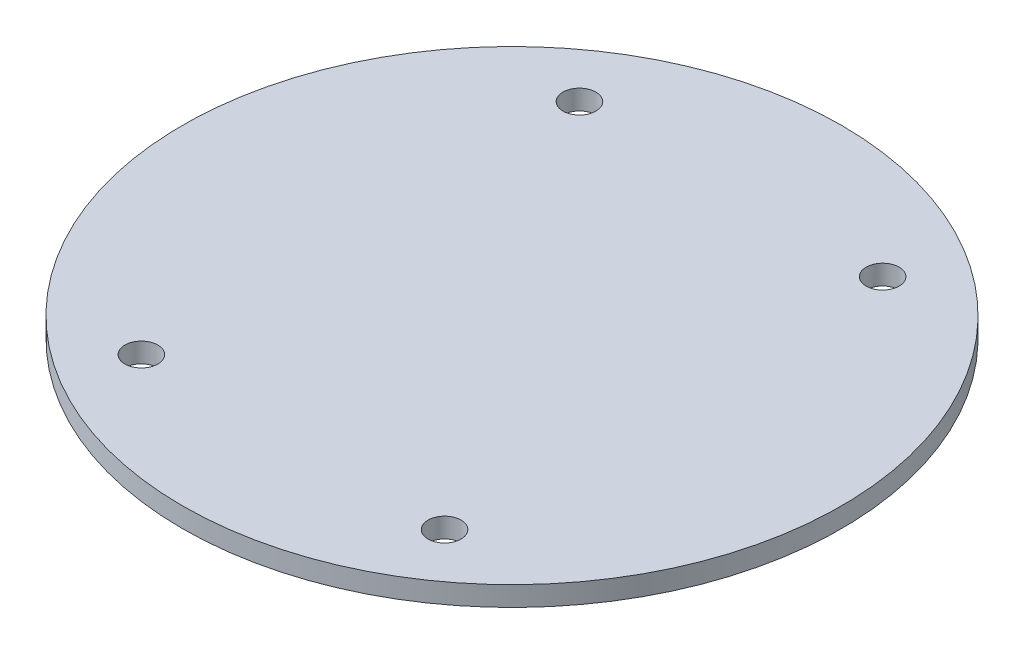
ISO-10303-21;
HEADER;
FILE_DESCRIPTION(('STEP AP214'),'2;1');
FILE_NAME('part.step','',(''),(''),'','','');
FILE_SCHEMA(('AUTOMOTIVE_DESIGN { 1 0 10303 214 1 1 1 1 }'));
ENDSEC;
DATA;
#1=APPLICATION_CONTEXT('core data for automotive mechanical design processes');
#2=APPLICATION_PROTOCOL_DEFINITION('international standard','automotive_design',2000,#1);
#3=PRODUCT_CONTEXT('',#1,'mechanical');
#4=PRODUCT('Part','Part','',(#3));
#5=PRODUCT_RELATED_PRODUCT_CATEGORY('part','',(#4));
#6=PRODUCT_DEFINITION_FORMATION('','',#4);
#7=PRODUCT_DEFINITION_CONTEXT('part definition',#1,'design');
#8=PRODUCT_DEFINITION('design','',#6,#7);
#9=PRODUCT_DEFINITION_SHAPE('','',#8);
#10=(LENGTH_UNIT() NAMED_UNIT(*) SI_UNIT(.MILLI.,.METRE.));
#11=(NAMED_UNIT(*) PLANE_ANGLE_UNIT() SI_UNIT($,.RADIAN.));
#12=(NAMED_UNIT(*) SI_UNIT($,.STERADIAN.) SOLID_ANGLE_UNIT());
#13=UNCERTAINTY_MEASURE_WITH_UNIT(LENGTH_MEASURE(1.E-05),#10,'distance_accuracy_value','');
#14=(GEOMETRIC_REPRESENTATION_CONTEXT(3) GLOBAL_UNCERTAINTY_ASSIGNED_CONTEXT((#13)) GLOBAL_UNIT_ASSIGNED_CONTEXT((#10,
#11,#12)) REPRESENTATION_CONTEXT('',''));
#15=CARTESIAN_POINT('',(0.,0.,0.));
#16=DIRECTION('',(0.,0.,1.));
#17=DIRECTION('',(1.,0.,0.));
#18=AXIS2_PLACEMENT_3D('',#15,#16,#17);
#19=CARTESIAN_POINT('',(0.,3.,0.));
#20=DIRECTION('',(0.,-1.,0.));
#21=DIRECTION('',(0.,0.,-1.));
#22=AXIS2_PLACEMENT_3D('',#19,#20,#21);
#23=CYLINDRICAL_SURFACE('',#22,50.);
#24=CARTESIAN_POINT('',(0.,3.,0.));
#25=DIRECTION('',(0.,1.,0.));
#26=DIRECTION('',(0.,0.,1.));
#27=AXIS2_PLACEMENT_3D('',#24,#25,#26);
#28=CIRCLE('',#27,50.);
#29=CARTESIAN_POINT('',(0.,3.,50.));
#30=VERTEX_POINT('',#29);
#31=EDGE_CURVE('E10',#30,#30,#28,.T.);
#32=ORIENTED_EDGE('',*,*,#31,.F.);
#33=EDGE_LOOP('',(#32));
#34=FACE_BOUND('',#33,.T.);
#35=CARTESIAN_POINT('',(0.,0.,0.));
#36=DIRECTION('',(0.,1.,0.));
#37=DIRECTION('',(0.,0.,1.));
#38=AXIS2_PLACEMENT_3D('',#35,#36,#37);
#39=CIRCLE('',#38,50.);
#40=CARTESIAN_POINT('',(0.,0.,50.));
#41=VERTEX_POINT('',#40);
#42=EDGE_CURVE('E34',#41,#41,#39,.T.);
#43=ORIENTED_EDGE('',*,*,#42,.T.);
#44=EDGE_LOOP('',(#43));
#45=FACE_BOUND('',#44,.T.);
#46=ADVANCED_FACE('F31',(#34,#45),#23,.T.);
#47=CARTESIAN_POINT('',(0.,3.,0.));
#48=DIRECTION('',(0.,1.,0.));
#49=DIRECTION('',(0.,0.,1.));
#50=AXIS2_PLACEMENT_3D('',#47,#48,#49);
#51=PLANE('',#50);
#52=CARTESIAN_POINT('',(-23.,3.,33.2340187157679));
#53=DIRECTION('',(0.,1.,0.));
#54=DIRECTION('',(0.,0.,-1.));
#55=AXIS2_PLACEMENT_3D('',#52,#53,#54);
#56=CIRCLE('',#55,2.5);
#57=CARTESIAN_POINT('',(-23.,3.,30.7340187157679));
#58=VERTEX_POINT('',#57);
#59=EDGE_CURVE('E61',#58,#58,#56,.T.);
#60=ORIENTED_EDGE('',*,*,#59,.F.);
#61=EDGE_LOOP('',(#60));
#62=FACE_BOUND('',#61,.T.);
#63=CARTESIAN_POINT('',(23.,3.,33.2340187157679));
#64=DIRECTION('',(0.,1.,0.));
#65=DIRECTION('',(0.,0.,1.));
#66=AXIS2_PLACEMENT_3D('',#63,#64,#65);
#67=CIRCLE('',#66,2.5);
#68=CARTESIAN_POINT('',(23.,3.,35.7340187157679));
#69=VERTEX_POINT('',#68);
#70=EDGE_CURVE('E55',#69,#69,#67,.T.);
#71=ORIENTED_EDGE('',*,*,#70,.F.);
#72=EDGE_LOOP('',(#71));
#73=FACE_BOUND('',#72,.T.);
#74=CARTESIAN_POINT('',(23.,3.,-33.2340187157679));
#75=DIRECTION('',(0.,1.,0.));
#76=DIRECTION('',(0.,0.,-1.));
#77=AXIS2_PLACEMENT_3D('',#74,#75,#76);
#78=CIRCLE('',#77,2.5);
#79=CARTESIAN_POINT('',(23.,3.,-35.7340187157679));
#80=VERTEX_POINT('',#79);
#81=EDGE_CURVE('E49',#80,#80,#78,.T.);
#82=ORIENTED_EDGE('',*,*,#81,.F.);
#83=EDGE_LOOP('',(#82));
#84=FACE_BOUND('',#83,.T.);
#85=CARTESIAN_POINT('',(-23.,3.,-33.2340187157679));
#86=DIRECTION('',(0.,1.,0.));
#87=DIRECTION('',(0.,0.,1.));
#88=AXIS2_PLACEMENT_3D('',#85,#86,#87);
#89=CIRCLE('',#88,2.5);
#90=CARTESIAN_POINT('',(-23.,3.,-30.7340187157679));
#91=VERTEX_POINT('',#90);
#92=EDGE_CURVE('E43',#91,#91,#89,.T.);
#93=ORIENTED_EDGE('',*,*,#92,.F.);
#94=EDGE_LOOP('',(#93));
#95=FACE_BOUND('',#94,.T.);
#96=ORIENTED_EDGE('',*,*,#31,.T.);
#97=EDGE_LOOP('',(#96));
#98=FACE_BOUND('',#97,.T.);
#99=ADVANCED_FACE('F77',(#62,#73,#84,#95,#98),#51,.T.);
#100=CARTESIAN_POINT('',(0.,0.,0.));
#101=DIRECTION('',(0.,1.,0.));
#102=DIRECTION('',(0.,0.,1.));
#103=AXIS2_PLACEMENT_3D('',#100,#101,#102);
#104=PLANE('',#103);
#105=CARTESIAN_POINT('',(-23.,0.,33.2340187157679));
#106=DIRECTION('',(0.,1.,0.));
#107=DIRECTION('',(0.,0.,-1.));
#108=AXIS2_PLACEMENT_3D('',#105,#106,#107);
#109=CIRCLE('',#108,2.5);
#110=CARTESIAN_POINT('',(-23.,0.,30.7340187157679));
#111=VERTEX_POINT('',#110);
#112=EDGE_CURVE('E58',#111,#111,#109,.T.);
#113=ORIENTED_EDGE('',*,*,#112,.T.);
#114=EDGE_LOOP('',(#113));
#115=FACE_BOUND('',#114,.T.);
#116=CARTESIAN_POINT('',(23.,0.,33.2340187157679));
#117=DIRECTION('',(0.,1.,0.));
#118=DIRECTION('',(0.,0.,1.));
#119=AXIS2_PLACEMENT_3D('',#116,#117,#118);
#120=CIRCLE('',#119,2.5);
#121=CARTESIAN_POINT('',(23.,0.,35.7340187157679));
#122=VERTEX_POINT('',#121);
#123=EDGE_CURVE('E52',#122,#122,#120,.T.);
#124=ORIENTED_EDGE('',*,*,#123,.T.);
#125=EDGE_LOOP('',(#124));
#126=FACE_BOUND('',#125,.T.);
#127=CARTESIAN_POINT('',(23.,0.,-33.2340187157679));
#128=DIRECTION('',(0.,1.,0.));
#129=DIRECTION('',(0.,0.,-1.));
#130=AXIS2_PLACEMENT_3D('',#127,#128,#129);
#131=CIRCLE('',#130,2.5);
#132=CARTESIAN_POINT('',(23.,0.,-35.7340187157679));
#133=VERTEX_POINT('',#132);
#134=EDGE_CURVE('E46',#133,#133,#131,.T.);
#135=ORIENTED_EDGE('',*,*,#134,.T.);
#136=EDGE_LOOP('',(#135));
#137=FACE_BOUND('',#136,.T.);
#138=CARTESIAN_POINT('',(-23.,0.,-33.2340187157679));
#139=DIRECTION('',(0.,1.,0.));
#140=DIRECTION('',(0.,0.,1.));
#141=AXIS2_PLACEMENT_3D('',#138,#139,#140);
#142=CIRCLE('',#141,2.5);
#143=CARTESIAN_POINT('',(-23.,0.,-30.7340187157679));
#144=VERTEX_POINT('',#143);
#145=EDGE_CURVE('E41',#144,#144,#142,.T.);
#146=ORIENTED_EDGE('',*,*,#145,.T.);
#147=EDGE_LOOP('',(#146));
#148=FACE_BOUND('',#147,.T.);
#149=ORIENTED_EDGE('',*,*,#42,.F.);
#150=EDGE_LOOP('',(#149));
#151=FACE_BOUND('',#150,.T.);
#152=ADVANCED_FACE('F67',(#115,#126,#137,#148,#151),#104,.F.);
#153=CARTESIAN_POINT('',(-23.,0.,-33.2340187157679));
#154=DIRECTION('',(0.,1.,0.));
#155=DIRECTION('',(0.,0.,1.));
#156=AXIS2_PLACEMENT_3D('',#153,#154,#155);
#157=CYLINDRICAL_SURFACE('',#156,2.5);
#158=ORIENTED_EDGE('',*,*,#145,.F.);
#159=EDGE_LOOP('',(#158));
#160=FACE_BOUND('',#159,.T.);
#161=ORIENTED_EDGE('',*,*,#92,.T.);
#162=EDGE_LOOP('',(#161));
#163=FACE_BOUND('',#162,.T.);
#164=ADVANCED_FACE('F87',(#160,#163),#157,.F.);
#165=CARTESIAN_POINT('',(23.,0.,-33.2340187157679));
#166=DIRECTION('',(0.,1.,0.));
#167=DIRECTION('',(0.,0.,1.));
#168=AXIS2_PLACEMENT_3D('',#165,#166,#167);
#169=CYLINDRICAL_SURFACE('',#168,2.5);
#170=ORIENTED_EDGE('',*,*,#134,.F.);
#171=EDGE_LOOP('',(#170));
#172=FACE_BOUND('',#171,.T.);
#173=ORIENTED_EDGE('',*,*,#81,.T.);
#174=EDGE_LOOP('',(#173));
#175=FACE_BOUND('',#174,.T.);
#176=ADVANCED_FACE('F89',(#172,#175),#169,.F.);
#177=CARTESIAN_POINT('',(23.,0.,33.2340187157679));
#178=DIRECTION('',(0.,1.,0.));
#179=DIRECTION('',(0.,0.,1.));
#180=AXIS2_PLACEMENT_3D('',#177,#178,#179);
#181=CYLINDRICAL_SURFACE('',#180,2.5);
#182=ORIENTED_EDGE('',*,*,#123,.F.);
#183=EDGE_LOOP('',(#182));
#184=FACE_BOUND('',#183,.T.);
#185=ORIENTED_EDGE('',*,*,#70,.T.);
#186=EDGE_LOOP('',(#185));
#187=FACE_BOUND('',#186,.T.);
#188=ADVANCED_FACE('F73',(#184,#187),#181,.F.);
#189=CARTESIAN_POINT('',(-23.,0.,33.2340187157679));
#190=DIRECTION('',(0.,1.,0.));
#191=DIRECTION('',(0.,0.,1.));
#192=AXIS2_PLACEMENT_3D('',#189,#190,#191);
#193=CYLINDRICAL_SURFACE('',#192,2.5);
#194=ORIENTED_EDGE('',*,*,#112,.F.);
#195=EDGE_LOOP('',(#194));
#196=FACE_BOUND('',#195,.T.);
#197=ORIENTED_EDGE('',*,*,#59,.T.);
#198=EDGE_LOOP('',(#197));
#199=FACE_BOUND('',#198,.T.);
#200=ADVANCED_FACE('F70',(#196,#199),#193,.F.);
#201=CLOSED_SHELL('',(#46,#99,#152,#164,#176,#188,#200));
#202=MANIFOLD_SOLID_BREP('B2',#201);
#203=ADVANCED_BREP_SHAPE_REPRESENTATION('',(#18,#202),#14);
#204=SHAPE_DEFINITION_REPRESENTATION(#9,#203);
ENDSEC;
END-ISO-10303-21;
